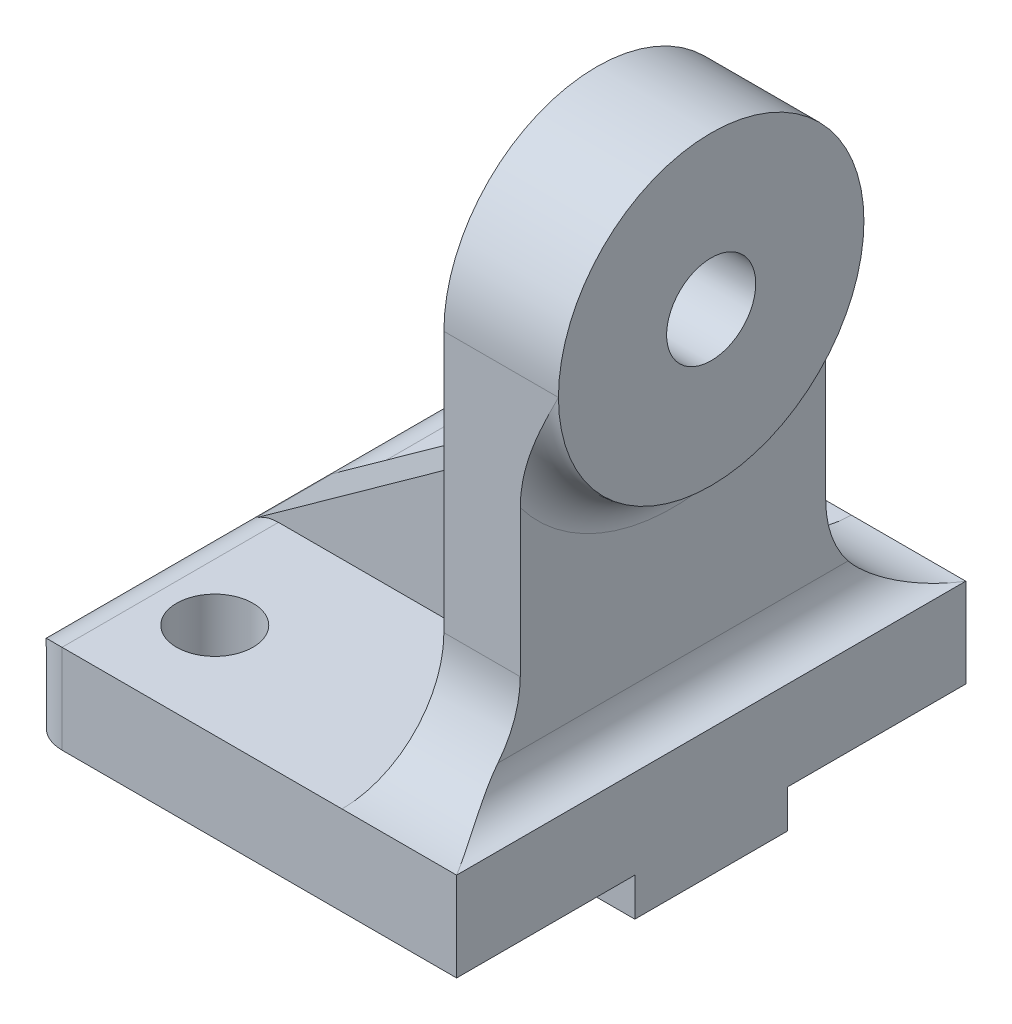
ISO-10303-21;
HEADER;
FILE_DESCRIPTION(('STEP AP214'),'2;1');
FILE_NAME('part.step','',(''),(''),'','','');
FILE_SCHEMA(('AUTOMOTIVE_DESIGN { 1 0 10303 214 1 1 1 1 }'));
ENDSEC;
DATA;
#1=APPLICATION_CONTEXT('core data for automotive mechanical design processes');
#2=APPLICATION_PROTOCOL_DEFINITION('international standard','automotive_design',2000,#1);
#3=PRODUCT_CONTEXT('',#1,'mechanical');
#4=PRODUCT('Part','Part','',(#3));
#5=PRODUCT_RELATED_PRODUCT_CATEGORY('part','',(#4));
#6=PRODUCT_DEFINITION_FORMATION('','',#4);
#7=PRODUCT_DEFINITION_CONTEXT('part definition',#1,'design');
#8=PRODUCT_DEFINITION('design','',#6,#7);
#9=PRODUCT_DEFINITION_SHAPE('','',#8);
#10=(LENGTH_UNIT() NAMED_UNIT(*) SI_UNIT(.MILLI.,.METRE.));
#11=(NAMED_UNIT(*) PLANE_ANGLE_UNIT() SI_UNIT($,.RADIAN.));
#12=(NAMED_UNIT(*) SI_UNIT($,.STERADIAN.) SOLID_ANGLE_UNIT());
#13=UNCERTAINTY_MEASURE_WITH_UNIT(LENGTH_MEASURE(1.E-05),#10,'distance_accuracy_value','');
#14=(GEOMETRIC_REPRESENTATION_CONTEXT(3) GLOBAL_UNCERTAINTY_ASSIGNED_CONTEXT((#13)) GLOBAL_UNIT_ASSIGNED_CONTEXT((#10,
#11,#12)) REPRESENTATION_CONTEXT('',''));
#15=CARTESIAN_POINT('',(0.,0.,0.));
#16=DIRECTION('',(0.,0.,1.));
#17=DIRECTION('',(1.,0.,0.));
#18=AXIS2_PLACEMENT_3D('',#15,#16,#17);
#19=CARTESIAN_POINT('',(6.,14.,-74.));
#20=DIRECTION('',(0.,-1.,0.));
#21=DIRECTION('',(0.,0.,-1.));
#22=AXIS2_PLACEMENT_3D('',#19,#20,#21);
#23=PLANE('',#22);
#24=CARTESIAN_POINT('',(15.,14.,-65.));
#25=DIRECTION('',(0.,1.,0.));
#26=DIRECTION('',(0.,0.,1.));
#27=AXIS2_PLACEMENT_3D('',#24,#25,#26);
#28=CIRCLE('',#27,6.);
#29=CARTESIAN_POINT('',(15.,14.,-59.));
#30=VERTEX_POINT('',#29);
#31=EDGE_CURVE('E441',#30,#30,#28,.T.);
#32=ORIENTED_EDGE('',*,*,#31,.F.);
#33=EDGE_LOOP('',(#32));
#34=FACE_BOUND('',#33,.T.);
#35=DIRECTION('',(1.,0.,0.));
#36=VECTOR('',#35,1.);
#37=CARTESIAN_POINT('',(50.,14.,-46.));
#38=LINE('',#37,#36);
#39=CARTESIAN_POINT('',(6.,14.,-46.));
#40=VERTEX_POINT('',#39);
#41=CARTESIAN_POINT('',(44.,14.,-46.));
#42=VERTEX_POINT('',#41);
#43=EDGE_CURVE('E206',#40,#42,#38,.T.);
#44=ORIENTED_EDGE('',*,*,#43,.T.);
#45=CARTESIAN_POINT('',(44.,14.,-52.));
#46=DIRECTION('',(0.,-1.,0.));
#47=DIRECTION('',(0.,0.,-1.));
#48=AXIS2_PLACEMENT_3D('',#45,#46,#47);
#49=CIRCLE('',#48,6.);
#50=CARTESIAN_POINT('',(50.,14.,-52.));
#51=VERTEX_POINT('',#50);
#52=EDGE_CURVE('E443',#42,#51,#49,.F.);
#53=ORIENTED_EDGE('',*,*,#52,.T.);
#54=DIRECTION('',(0.,0.,-1.));
#55=VECTOR('',#54,1.);
#56=CARTESIAN_POINT('',(50.,14.,0.));
#57=LINE('',#56,#55);
#58=CARTESIAN_POINT('',(50.,14.,-80.));
#59=VERTEX_POINT('',#58);
#60=EDGE_CURVE('E253',#51,#59,#57,.T.);
#61=ORIENTED_EDGE('',*,*,#60,.T.);
#62=DIRECTION('',(-1.,0.,0.));
#63=VECTOR('',#62,1.);
#64=CARTESIAN_POINT('',(6.00000000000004,14.,-80.));
#65=LINE('',#64,#63);
#66=CARTESIAN_POINT('',(6.00000000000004,14.,-80.));
#67=VERTEX_POINT('',#66);
#68=EDGE_CURVE('E526',#59,#67,#65,.T.);
#69=ORIENTED_EDGE('',*,*,#68,.T.);
#70=DIRECTION('',(0.,0.,1.));
#71=VECTOR('',#70,1.);
#72=CARTESIAN_POINT('',(6.,14.,-74.));
#73=LINE('',#72,#71);
#74=EDGE_CURVE('E446',#67,#40,#73,.T.);
#75=ORIENTED_EDGE('',*,*,#74,.T.);
#76=EDGE_LOOP('',(#44,#53,#61,#69,#75));
#77=FACE_BOUND('',#76,.T.);
#78=ADVANCED_FACE('F31',(#34,#77),#23,.F.);
#79=CARTESIAN_POINT('',(68.,14.,0.));
#80=DIRECTION('',(-1.,0.,0.));
#81=DIRECTION('',(0.,0.,1.));
#82=AXIS2_PLACEMENT_3D('',#79,#80,#81);
#83=PLANE('',#82);
#84=CARTESIAN_POINT('',(68.,71.,-40.));
#85=DIRECTION('',(1.,0.,0.));
#86=DIRECTION('',(0.,0.,-1.));
#87=AXIS2_PLACEMENT_3D('',#84,#85,#86);
#88=CIRCLE('',#87,7.);
#89=CARTESIAN_POINT('',(68.,71.,-47.));
#90=VERTEX_POINT('',#89);
#91=EDGE_CURVE('E234',#90,#90,#88,.T.);
#92=ORIENTED_EDGE('',*,*,#91,.F.);
#93=EDGE_LOOP('',(#92));
#94=FACE_BOUND('',#93,.T.);
#95=CARTESIAN_POINT('',(68.,71.,-40.));
#96=DIRECTION('',(1.,0.,0.));
#97=DIRECTION('',(0.,0.,-1.));
#98=AXIS2_PLACEMENT_3D('',#95,#96,#97);
#99=CIRCLE('',#98,24.);
#100=CARTESIAN_POINT('',(68.,71.,-64.));
#101=VERTEX_POINT('',#100);
#102=CARTESIAN_POINT('',(68.,71.,-16.));
#103=VERTEX_POINT('',#102);
#104=EDGE_CURVE('E241',#101,#103,#99,.T.);
#105=ORIENTED_EDGE('',*,*,#104,.T.);
#106=EDGE_CURVE('E240',#103,#101,#99,.T.);
#107=ORIENTED_EDGE('',*,*,#106,.T.);
#108=EDGE_LOOP('',(#105,#107));
#109=FACE_BOUND('',#108,.T.);
#110=ADVANCED_FACE('F430',(#94,#109),#83,.F.);
#111=CARTESIAN_POINT('',(50.,71.,-64.));
#112=DIRECTION('',(0.,0.,-1.));
#113=DIRECTION('',(-1.,0.,0.));
#114=AXIS2_PLACEMENT_3D('',#111,#112,#113);
#115=PLANE('',#114);
#116=DIRECTION('',(1.,0.,0.));
#117=VECTOR('',#116,1.);
#118=CARTESIAN_POINT('',(50.,71.,-64.));
#119=LINE('',#118,#117);
#120=CARTESIAN_POINT('',(50.,71.,-64.));
#121=VERTEX_POINT('',#120);
#122=EDGE_CURVE('E263',#121,#101,#119,.T.);
#123=ORIENTED_EDGE('',*,*,#122,.T.);
#124=CARTESIAN_POINT('',(62.,53.,-64.));
#125=CARTESIAN_POINT('',(62.000029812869,53.3181540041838,-64.));
#126=CARTESIAN_POINT('',(62.0091079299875,53.6362128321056,-64.));
#127=CARTESIAN_POINT('',(62.0437153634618,54.2712663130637,-64.));
#128=CARTESIAN_POINT('',(62.0692353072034,54.5882614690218,-64.));
#129=CARTESIAN_POINT('',(62.1349879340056,55.2197479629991,-64.));
#130=CARTESIAN_POINT('',(62.1751771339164,55.5342439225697,-64.));
#131=CARTESIAN_POINT('',(62.2688601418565,56.161272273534,-64.));
#132=CARTESIAN_POINT('',(62.322356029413,56.473804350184,-64.));
#133=CARTESIAN_POINT('',(62.4992524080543,57.3997546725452,-64.));
#134=CARTESIAN_POINT('',(62.6400061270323,58.0098916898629,-64.));
#135=CARTESIAN_POINT('',(62.9594935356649,59.2204557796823,-64.));
#136=CARTESIAN_POINT('',(63.1382598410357,59.8208740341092,-64.));
#137=CARTESIAN_POINT('',(63.4810838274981,60.8728166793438,-64.));
#138=CARTESIAN_POINT('',(63.6388530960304,61.3264172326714,-64.));
#139=CARTESIAN_POINT('',(63.9694736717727,62.2281048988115,-64.));
#140=CARTESIAN_POINT('',(64.1423262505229,62.6761915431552,-64.));
#141=CARTESIAN_POINT('',(64.679497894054,64.0129020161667,-64.));
#142=CARTESIAN_POINT('',(65.062445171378,64.8940186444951,-64.));
#143=CARTESIAN_POINT('',(65.8610721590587,66.645119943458,-64.));
#144=CARTESIAN_POINT('',(66.2768740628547,67.5150475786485,-64.));
#145=CARTESIAN_POINT('',(67.1238083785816,69.2474292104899,-64.));
#146=CARTESIAN_POINT('',(67.5549422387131,70.1098824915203,-64.));
#147=CARTESIAN_POINT('',(67.9907623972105,70.981524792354,-64.));
#148=CARTESIAN_POINT('',(67.99538119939,70.9907623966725,-64.));
#149=CARTESIAN_POINT('',(68.,71.,-64.));
#150=B_SPLINE_CURVE_WITH_KNOTS('',3,(#124,#125,#126,#127,#128,#129,#130,#131,#132,#133,#134,
#135,#136,#137,#138,#139,#140,#141,#142,#143,#144,#145,#146,#147,#148,#149),.UNSPECIFIED.,.F.,
.F.,(4,2,2,2,2,2,2,2,2,2,2,2,4),(0.,0.954195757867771,1.90784805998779,2.85869616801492,
3.80969296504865,5.68650542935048,7.5649347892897,9.00540329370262,10.4459933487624,
13.3270398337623,16.2193574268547,19.1119489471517,19.1429328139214),.UNSPECIFIED.);
#151=CARTESIAN_POINT('',(62.,53.,-64.));
#152=VERTEX_POINT('',#151);
#153=EDGE_CURVE('E339',#101,#152,#150,.F.);
#154=ORIENTED_EDGE('',*,*,#153,.T.);
#155=DIRECTION('',(0.,1.,0.));
#156=VECTOR('',#155,1.);
#157=CARTESIAN_POINT('',(62.,71.,-64.));
#158=LINE('',#157,#156);
#159=CARTESIAN_POINT('',(62.,30.,-64.));
#160=VERTEX_POINT('',#159);
#161=EDGE_CURVE('E229',#160,#152,#158,.T.);
#162=ORIENTED_EDGE('',*,*,#161,.F.);
#163=DIRECTION('',(1.,0.,0.));
#164=VECTOR('',#163,1.);
#165=CARTESIAN_POINT('',(50.,30.,-64.));
#166=LINE('',#165,#164);
#167=CARTESIAN_POINT('',(50.,30.,-64.));
#168=VERTEX_POINT('',#167);
#169=EDGE_CURVE('E266',#168,#160,#166,.T.);
#170=ORIENTED_EDGE('',*,*,#169,.F.);
#171=DIRECTION('',(0.,1.,0.));
#172=VECTOR('',#171,1.);
#173=CARTESIAN_POINT('',(50.,71.,-64.));
#174=LINE('',#173,#172);
#175=EDGE_CURVE('E259',#168,#121,#174,.T.);
#176=ORIENTED_EDGE('',*,*,#175,.T.);
#177=EDGE_LOOP('',(#123,#154,#162,#170,#176));
#178=FACE_BOUND('',#177,.T.);
#179=ADVANCED_FACE('F436',(#178),#115,.T.);
#180=CARTESIAN_POINT('',(50.,30.,-80.));
#181=DIRECTION('',(1.,0.,0.));
#182=DIRECTION('',(0.,0.,-1.));
#183=AXIS2_PLACEMENT_3D('',#180,#181,#182);
#184=CYLINDRICAL_SURFACE('',#183,16.);
#185=ORIENTED_EDGE('',*,*,#169,.T.);
#186=CARTESIAN_POINT('',(62.,30.,-80.));
#187=DIRECTION('',(-1.,0.,0.));
#188=DIRECTION('',(0.,0.,-1.));
#189=AXIS2_PLACEMENT_3D('',#186,#187,#188);
#190=CIRCLE('',#189,16.);
#191=CARTESIAN_POINT('',(62.,20.,-67.5100040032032));
#192=VERTEX_POINT('',#191);
#193=EDGE_CURVE('E227',#192,#160,#190,.T.);
#194=ORIENTED_EDGE('',*,*,#193,.F.);
#195=CARTESIAN_POINT('',(62.,20.,-67.5100040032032));
#196=CARTESIAN_POINT('',(62.0000229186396,19.8002548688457,-67.6698796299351));
#197=CARTESIAN_POINT('',(62.0099695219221,19.6045281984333,-67.8344938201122));
#198=CARTESIAN_POINT('',(62.0475068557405,19.222386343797,-68.1717475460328));
#199=CARTESIAN_POINT('',(62.0750702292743,19.0359572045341,-68.3443742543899));
#200=CARTESIAN_POINT('',(62.145346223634,18.6746293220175,-68.6951804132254));
#201=CARTESIAN_POINT('',(62.187925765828,18.4996448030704,-68.8732989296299));
#202=CARTESIAN_POINT('',(62.2864064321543,18.1598489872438,-69.2355894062));
#203=CARTESIAN_POINT('',(62.3423148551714,17.9950433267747,-69.4197646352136));
#204=CARTESIAN_POINT('',(62.4967237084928,17.595837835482,-69.8869976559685));
#205=CARTESIAN_POINT('',(62.6025181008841,17.368019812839,-70.1732938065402));
#206=CARTESIAN_POINT('',(62.8353556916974,16.9362370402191,-70.7550312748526));
#207=CARTESIAN_POINT('',(62.9624055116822,16.7322797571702,-71.0504754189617));
#208=CARTESIAN_POINT('',(63.2345049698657,16.3467782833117,-71.6503081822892));
#209=CARTESIAN_POINT('',(63.379653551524,16.1653691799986,-71.954738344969));
#210=CARTESIAN_POINT('',(63.6840108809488,15.8257665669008,-72.5693602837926));
#211=CARTESIAN_POINT('',(63.8432196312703,15.6675730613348,-72.8795520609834));
#212=CARTESIAN_POINT('',(64.241826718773,15.3123360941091,-73.6350804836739));
#213=CARTESIAN_POINT('',(64.4869495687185,15.1266531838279,-74.0827633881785));
#214=CARTESIAN_POINT('',(64.9936661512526,14.7987436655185,-74.9847965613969));
#215=CARTESIAN_POINT('',(65.2552681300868,14.6565390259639,-75.4391500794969));
#216=CARTESIAN_POINT('',(65.789251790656,14.4144528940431,-76.3513152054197));
#217=CARTESIAN_POINT('',(66.0616092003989,14.3144814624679,-76.8091173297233));
#218=CARTESIAN_POINT('',(66.6133077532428,14.1553917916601,-77.7272659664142));
#219=CARTESIAN_POINT('',(66.8926449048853,14.0962507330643,-78.1876109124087));
#220=CARTESIAN_POINT('',(67.3086684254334,14.0384026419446,-78.8700367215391));
#221=CARTESIAN_POINT('',(67.4440943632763,14.0242609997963,-79.0916904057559));
#222=CARTESIAN_POINT('',(67.7152789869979,14.0052190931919,-79.5350445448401));
#223=CARTESIAN_POINT('',(67.8510374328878,14.0003134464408,-79.756744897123));
#224=CARTESIAN_POINT('',(67.9911923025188,14.0000048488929,-79.9856170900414));
#225=CARTESIAN_POINT('',(67.9955961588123,14.0000000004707,-79.9928085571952));
#226=CARTESIAN_POINT('',(68.,14.,-80.));
#227=B_SPLINE_CURVE_WITH_KNOTS('',3,(#195,#196,#197,#198,#199,#200,#201,#202,#203,#204,#205,
#206,#207,#208,#209,#210,#211,#212,#213,#214,#215,#216,#217,#218,#219,#220,#221,#222,#223,#224,
#225,#226),.UNSPECIFIED.,.F.,.F.,(4,2,2,2,2,2,2,2,2,2,2,2,2,2,2,4),(0.,0.767024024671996,
1.53285982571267,2.29207235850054,3.05170159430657,4.19255688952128,5.33376825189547,
6.48151709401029,7.62926614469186,9.25627785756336,10.8841103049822,12.5084584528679,
14.1318980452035,14.9121815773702,15.6920102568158,15.7173084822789),.UNSPECIFIED.);
#228=CARTESIAN_POINT('',(68.,14.,-80.));
#229=VERTEX_POINT('',#228);
#230=EDGE_CURVE('E476',#192,#229,#227,.T.);
#231=ORIENTED_EDGE('',*,*,#230,.T.);
#232=EDGE_CURVE('E521',#229,#59,#65,.T.);
#233=ORIENTED_EDGE('',*,*,#232,.T.);
#234=CARTESIAN_POINT('',(50.,30.,-80.));
#235=DIRECTION('',(-1.,0.,0.));
#236=DIRECTION('',(0.,0.,-1.));
#237=AXIS2_PLACEMENT_3D('',#234,#235,#236);
#238=CIRCLE('',#237,16.);
#239=EDGE_CURVE('E256',#59,#168,#238,.T.);
#240=ORIENTED_EDGE('',*,*,#239,.T.);
#241=EDGE_LOOP('',(#185,#194,#231,#233,#240));
#242=FACE_BOUND('',#241,.T.);
#243=ADVANCED_FACE('F757',(#242),#184,.F.);
#244=CARTESIAN_POINT('',(50.,30.,0.));
#245=DIRECTION('',(1.,0.,0.));
#246=DIRECTION('',(0.,0.,-1.));
#247=AXIS2_PLACEMENT_3D('',#244,#245,#246);
#248=CYLINDRICAL_SURFACE('',#247,16.);
#249=DIRECTION('',(1.,0.,0.));
#250=VECTOR('',#249,1.);
#251=CARTESIAN_POINT('',(50.,14.,0.));
#252=LINE('',#251,#250);
#253=CARTESIAN_POINT('',(50.,14.,0.));
#254=VERTEX_POINT('',#253);
#255=CARTESIAN_POINT('',(68.,14.,0.));
#256=VERTEX_POINT('',#255);
#257=EDGE_CURVE('E269',#254,#256,#252,.T.);
#258=ORIENTED_EDGE('',*,*,#257,.T.);
#259=CARTESIAN_POINT('',(62.,20.,-12.4899959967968));
#260=CARTESIAN_POINT('',(62.0000229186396,19.8002548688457,-12.3301203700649));
#261=CARTESIAN_POINT('',(62.0099695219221,19.6045281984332,-12.1655061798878));
#262=CARTESIAN_POINT('',(62.0475068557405,19.2223863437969,-11.8282524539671));
#263=CARTESIAN_POINT('',(62.0750702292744,19.035957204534,-11.65562574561));
#264=CARTESIAN_POINT('',(62.145346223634,18.6746293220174,-11.3048195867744));
#265=CARTESIAN_POINT('',(62.1879257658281,18.4996448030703,-11.12670107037));
#266=CARTESIAN_POINT('',(62.2864064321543,18.1598489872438,-10.7644105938));
#267=CARTESIAN_POINT('',(62.3423148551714,17.9950433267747,-10.5802353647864));
#268=CARTESIAN_POINT('',(62.4967237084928,17.595837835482,-10.1130023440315));
#269=CARTESIAN_POINT('',(62.6025181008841,17.368019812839,-9.8267061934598));
#270=CARTESIAN_POINT('',(62.8353556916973,16.9362370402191,-9.24496872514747));
#271=CARTESIAN_POINT('',(62.9624055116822,16.7322797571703,-8.94952458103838));
#272=CARTESIAN_POINT('',(63.2345049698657,16.3467782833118,-8.34969181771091));
#273=CARTESIAN_POINT('',(63.379653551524,16.1653691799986,-8.0452616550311));
#274=CARTESIAN_POINT('',(63.6840108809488,15.8257665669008,-7.43063971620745));
#275=CARTESIAN_POINT('',(63.8432196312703,15.6675730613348,-7.12044793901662));
#276=CARTESIAN_POINT('',(64.241826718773,15.3123360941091,-6.36491951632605));
#277=CARTESIAN_POINT('',(64.4869495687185,15.1266531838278,-5.91723661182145));
#278=CARTESIAN_POINT('',(64.9936661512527,14.7987436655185,-5.01520343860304));
#279=CARTESIAN_POINT('',(65.2552681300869,14.6565390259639,-4.56084992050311));
#280=CARTESIAN_POINT('',(65.789251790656,14.4144528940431,-3.64868479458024));
#281=CARTESIAN_POINT('',(66.0616092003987,14.3144814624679,-3.19088267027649));
#282=CARTESIAN_POINT('',(66.613307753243,14.1553917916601,-2.2727340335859));
#283=CARTESIAN_POINT('',(66.892644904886,14.0962507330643,-1.8123890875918));
#284=CARTESIAN_POINT('',(67.308668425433,14.0384026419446,-1.12996327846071));
#285=CARTESIAN_POINT('',(67.4440943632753,14.0242609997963,-0.908309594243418));
#286=CARTESIAN_POINT('',(67.715278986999,14.0052190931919,-0.464955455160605));
#287=CARTESIAN_POINT('',(67.8510374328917,14.0003134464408,-0.243255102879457));
#288=CARTESIAN_POINT('',(67.991192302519,14.0000048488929,-0.0143829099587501));
#289=CARTESIAN_POINT('',(67.9955961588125,14.0000000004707,-0.0071914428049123));
#290=CARTESIAN_POINT('',(68.,14.,0.));
#291=B_SPLINE_CURVE_WITH_KNOTS('',3,(#259,#260,#261,#262,#263,#264,#265,#266,#267,#268,#269,
#270,#271,#272,#273,#274,#275,#276,#277,#278,#279,#280,#281,#282,#283,#284,#285,#286,#287,#288,
#289,#290),.UNSPECIFIED.,.F.,.F.,(4,2,2,2,2,2,2,2,2,2,2,2,2,2,2,4),(0.,0.767024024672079,
1.53285982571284,2.29207235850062,3.05170159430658,4.19255688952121,5.33376825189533,
6.48151709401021,7.62926614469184,9.25627785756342,10.8841103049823,12.508458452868,
14.1318980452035,14.9121815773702,15.6920102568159,15.7173084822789),.UNSPECIFIED.);
#292=CARTESIAN_POINT('',(62.,20.,-12.4899959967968));
#293=VERTEX_POINT('',#292);
#294=EDGE_CURVE('E472',#256,#293,#291,.F.);
#295=ORIENTED_EDGE('',*,*,#294,.T.);
#296=CARTESIAN_POINT('',(62.,30.,0.));
#297=DIRECTION('',(-1.,0.,0.));
#298=DIRECTION('',(0.,0.,-1.));
#299=AXIS2_PLACEMENT_3D('',#296,#297,#298);
#300=CIRCLE('',#299,16.);
#301=CARTESIAN_POINT('',(62.,30.,-16.));
#302=VERTEX_POINT('',#301);
#303=EDGE_CURVE('E224',#302,#293,#300,.T.);
#304=ORIENTED_EDGE('',*,*,#303,.F.);
#305=DIRECTION('',(1.,0.,0.));
#306=VECTOR('',#305,1.);
#307=CARTESIAN_POINT('',(50.,30.,-16.));
#308=LINE('',#307,#306);
#309=CARTESIAN_POINT('',(50.,30.,-16.));
#310=VERTEX_POINT('',#309);
#311=EDGE_CURVE('E271',#310,#302,#308,.T.);
#312=ORIENTED_EDGE('',*,*,#311,.F.);
#313=CARTESIAN_POINT('',(50.,30.,0.));
#314=DIRECTION('',(-1.,0.,0.));
#315=DIRECTION('',(0.,0.,-1.));
#316=AXIS2_PLACEMENT_3D('',#313,#314,#315);
#317=CIRCLE('',#316,16.);
#318=EDGE_CURVE('E250',#310,#254,#317,.T.);
#319=ORIENTED_EDGE('',*,*,#318,.T.);
#320=EDGE_LOOP('',(#258,#295,#304,#312,#319));
#321=FACE_BOUND('',#320,.T.);
#322=ADVANCED_FACE('F355',(#321),#248,.F.);
#323=CARTESIAN_POINT('',(50.,71.,-16.));
#324=DIRECTION('',(0.,0.,1.));
#325=DIRECTION('',(0.,-1.,0.));
#326=AXIS2_PLACEMENT_3D('',#323,#324,#325);
#327=PLANE('',#326);
#328=ORIENTED_EDGE('',*,*,#311,.T.);
#329=DIRECTION('',(0.,-1.,0.));
#330=VECTOR('',#329,1.);
#331=CARTESIAN_POINT('',(62.,71.,-16.));
#332=LINE('',#331,#330);
#333=CARTESIAN_POINT('',(62.,53.,-16.));
#334=VERTEX_POINT('',#333);
#335=EDGE_CURVE('E232',#334,#302,#332,.T.);
#336=ORIENTED_EDGE('',*,*,#335,.F.);
#337=CARTESIAN_POINT('',(62.,53.,-16.));
#338=CARTESIAN_POINT('',(62.000029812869,53.318154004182,-16.));
#339=CARTESIAN_POINT('',(62.0091079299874,53.6362128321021,-16.));
#340=CARTESIAN_POINT('',(62.0437153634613,54.2712663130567,-16.));
#341=CARTESIAN_POINT('',(62.0692353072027,54.5882614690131,-16.));
#342=CARTESIAN_POINT('',(62.1349879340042,55.2197479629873,-16.));
#343=CARTESIAN_POINT('',(62.1751771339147,55.5342439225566,-16.));
#344=CARTESIAN_POINT('',(62.268860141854,56.1612722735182,-16.));
#345=CARTESIAN_POINT('',(62.32235602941,56.4738043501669,-16.));
#346=CARTESIAN_POINT('',(62.4992524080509,57.3997546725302,-16.));
#347=CARTESIAN_POINT('',(62.6400061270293,58.0098916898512,-16.));
#348=CARTESIAN_POINT('',(62.9594935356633,59.2204557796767,-16.));
#349=CARTESIAN_POINT('',(63.1382598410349,59.8208740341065,-16.));
#350=CARTESIAN_POINT('',(63.4810838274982,60.8728166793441,-16.));
#351=CARTESIAN_POINT('',(63.6388530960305,61.326417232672,-16.));
#352=CARTESIAN_POINT('',(63.9694736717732,62.2281048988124,-16.));
#353=CARTESIAN_POINT('',(64.1423262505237,62.6761915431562,-16.));
#354=CARTESIAN_POINT('',(64.6794978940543,64.0129020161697,-16.));
#355=CARTESIAN_POINT('',(65.0624451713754,64.894018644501,-16.));
#356=CARTESIAN_POINT('',(65.861072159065,66.6451199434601,-16.));
#357=CARTESIAN_POINT('',(66.2768740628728,67.5150475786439,-16.));
#358=CARTESIAN_POINT('',(67.1238083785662,69.2474292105,-16.));
#359=CARTESIAN_POINT('',(67.5549422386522,70.1098824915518,-15.9999999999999));
#360=CARTESIAN_POINT('',(67.9907623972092,70.9815247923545,-16.));
#361=CARTESIAN_POINT('',(67.9953811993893,70.9907623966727,-16.));
#362=CARTESIAN_POINT('',(68.,71.,-16.));
#363=B_SPLINE_CURVE_WITH_KNOTS('',3,(#337,#338,#339,#340,#341,#342,#343,#344,#345,#346,#347,
#348,#349,#350,#351,#352,#353,#354,#355,#356,#357,#358,#359,#360,#361,#362),.UNSPECIFIED.,.F.,
.F.,(4,2,2,2,2,2,2,2,2,2,2,2,4),(0.,0.95419575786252,1.90784805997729,2.85869616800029,
3.80969296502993,5.68650542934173,7.56493478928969,9.00540329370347,10.4459933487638,
13.3270398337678,16.2193574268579,19.1119489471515,19.1429328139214),.UNSPECIFIED.);
#364=EDGE_CURVE('E331',#334,#103,#363,.T.);
#365=ORIENTED_EDGE('',*,*,#364,.T.);
#366=DIRECTION('',(1.,0.,0.));
#367=VECTOR('',#366,1.);
#368=CARTESIAN_POINT('',(50.,71.,-16.));
#369=LINE('',#368,#367);
#370=CARTESIAN_POINT('',(50.,71.,-16.));
#371=VERTEX_POINT('',#370);
#372=EDGE_CURVE('E262',#371,#103,#369,.T.);
#373=ORIENTED_EDGE('',*,*,#372,.F.);
#374=DIRECTION('',(0.,-1.,0.));
#375=VECTOR('',#374,1.);
#376=CARTESIAN_POINT('',(50.,71.,-16.));
#377=LINE('',#376,#375);
#378=EDGE_CURVE('E247',#371,#310,#377,.T.);
#379=ORIENTED_EDGE('',*,*,#378,.T.);
#380=EDGE_LOOP('',(#328,#336,#365,#373,#379));
#381=FACE_BOUND('',#380,.T.);
#382=ADVANCED_FACE('F349',(#381),#327,.T.);
#383=CARTESIAN_POINT('',(15.,14.,-15.));
#384=DIRECTION('',(0.,1.,0.));
#385=DIRECTION('',(0.,0.,1.));
#386=AXIS2_PLACEMENT_3D('',#383,#384,#385);
#387=CIRCLE('',#386,6.);
#388=CARTESIAN_POINT('',(15.,14.,-9.));
#389=VERTEX_POINT('',#388);
#390=EDGE_CURVE('E588',#389,#389,#387,.T.);
#391=ORIENTED_EDGE('',*,*,#390,.F.);
#392=EDGE_LOOP('',(#391));
#393=FACE_BOUND('',#392,.T.);
#394=CARTESIAN_POINT('',(50.,14.,-28.));
#395=VERTEX_POINT('',#394);
#396=EDGE_CURVE('E254',#254,#395,#57,.T.);
#397=ORIENTED_EDGE('',*,*,#396,.T.);
#398=CARTESIAN_POINT('',(44.,14.,-28.));
#399=DIRECTION('',(0.,-1.,0.));
#400=DIRECTION('',(0.,0.,-1.));
#401=AXIS2_PLACEMENT_3D('',#398,#399,#400);
#402=CIRCLE('',#401,6.);
#403=CARTESIAN_POINT('',(44.,14.,-34.));
#404=VERTEX_POINT('',#403);
#405=EDGE_CURVE('E46',#395,#404,#402,.F.);
#406=ORIENTED_EDGE('',*,*,#405,.T.);
#407=DIRECTION('',(1.,0.,0.));
#408=VECTOR('',#407,1.);
#409=CARTESIAN_POINT('',(50.,14.,-34.));
#410=LINE('',#409,#408);
#411=CARTESIAN_POINT('',(6.,14.,-34.));
#412=VERTEX_POINT('',#411);
#413=EDGE_CURVE('E215',#412,#404,#410,.T.);
#414=ORIENTED_EDGE('',*,*,#413,.F.);
#415=CARTESIAN_POINT('',(6.00000000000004,14.,0.));
#416=VERTEX_POINT('',#415);
#417=EDGE_CURVE('E471',#412,#416,#73,.T.);
#418=ORIENTED_EDGE('',*,*,#417,.T.);
#419=DIRECTION('',(1.,0.,0.));
#420=VECTOR('',#419,1.);
#421=CARTESIAN_POINT('',(6.00000000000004,14.,0.));
#422=LINE('',#421,#420);
#423=EDGE_CURVE('E518',#416,#254,#422,.T.);
#424=ORIENTED_EDGE('',*,*,#423,.T.);
#425=EDGE_LOOP('',(#397,#406,#414,#418,#424));
#426=FACE_BOUND('',#425,.T.);
#427=ADVANCED_FACE('F354',(#393,#426),#23,.F.);
#428=CARTESIAN_POINT('',(6.,0.,-74.));
#429=DIRECTION('',(0.,-1.,0.));
#430=DIRECTION('',(0.,0.,-1.));
#431=AXIS2_PLACEMENT_3D('',#428,#429,#430);
#432=PLANE('',#431);
#433=DIRECTION('',(1.,0.,0.));
#434=VECTOR('',#433,1.);
#435=CARTESIAN_POINT('',(68.,0.,-52.));
#436=LINE('',#435,#434);
#437=CARTESIAN_POINT('',(0.,0.,-52.));
#438=VERTEX_POINT('',#437);
#439=CARTESIAN_POINT('',(68.,0.,-52.));
#440=VERTEX_POINT('',#439);
#441=EDGE_CURVE('E295',#438,#440,#436,.T.);
#442=ORIENTED_EDGE('',*,*,#441,.F.);
#443=DIRECTION('',(0.,0.,1.));
#444=VECTOR('',#443,1.);
#445=CARTESIAN_POINT('',(0.,0.,-6.00000000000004));
#446=LINE('',#445,#444);
#447=CARTESIAN_POINT('',(0.,0.,-74.));
#448=VERTEX_POINT('',#447);
#449=EDGE_CURVE('E555',#448,#438,#446,.T.);
#450=ORIENTED_EDGE('',*,*,#449,.F.);
#451=CARTESIAN_POINT('',(6.,0.,-74.));
#452=DIRECTION('',(0.,1.,0.));
#453=DIRECTION('',(0.,0.,-1.));
#454=AXIS2_PLACEMENT_3D('',#451,#452,#453);
#455=CIRCLE('',#454,6.);
#456=CARTESIAN_POINT('',(6.00000000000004,0.,-80.));
#457=VERTEX_POINT('',#456);
#458=EDGE_CURVE('E550',#457,#448,#455,.T.);
#459=ORIENTED_EDGE('',*,*,#458,.F.);
#460=DIRECTION('',(-1.,0.,0.));
#461=VECTOR('',#460,1.);
#462=CARTESIAN_POINT('',(6.00000000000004,0.,-80.));
#463=LINE('',#462,#461);
#464=CARTESIAN_POINT('',(68.,0.,-80.));
#465=VERTEX_POINT('',#464);
#466=EDGE_CURVE('E542',#465,#457,#463,.T.);
#467=ORIENTED_EDGE('',*,*,#466,.F.);
#468=DIRECTION('',(0.,0.,-1.));
#469=VECTOR('',#468,1.);
#470=CARTESIAN_POINT('',(68.,0.,0.));
#471=LINE('',#470,#469);
#472=EDGE_CURVE('E543',#440,#465,#471,.T.);
#473=ORIENTED_EDGE('',*,*,#472,.F.);
#474=EDGE_LOOP('',(#442,#450,#459,#467,#473));
#475=FACE_BOUND('',#474,.T.);
#476=CARTESIAN_POINT('',(15.,0.,-65.));
#477=DIRECTION('',(0.,1.,0.));
#478=DIRECTION('',(0.,0.,1.));
#479=AXIS2_PLACEMENT_3D('',#476,#477,#478);
#480=CIRCLE('',#479,6.);
#481=CARTESIAN_POINT('',(15.,0.,-59.));
#482=VERTEX_POINT('',#481);
#483=EDGE_CURVE('E590',#482,#482,#480,.T.);
#484=ORIENTED_EDGE('',*,*,#483,.T.);
#485=EDGE_LOOP('',(#484));
#486=FACE_BOUND('',#485,.T.);
#487=ADVANCED_FACE('F404',(#475,#486),#432,.T.);
#488=DIRECTION('',(-1.,0.,0.));
#489=VECTOR('',#488,1.);
#490=CARTESIAN_POINT('',(68.,0.,-28.));
#491=LINE('',#490,#489);
#492=CARTESIAN_POINT('',(68.,0.,-28.));
#493=VERTEX_POINT('',#492);
#494=CARTESIAN_POINT('',(0.,0.,-28.));
#495=VERTEX_POINT('',#494);
#496=EDGE_CURVE('E286',#493,#495,#491,.T.);
#497=ORIENTED_EDGE('',*,*,#496,.F.);
#498=CARTESIAN_POINT('',(68.,0.,0.));
#499=VERTEX_POINT('',#498);
#500=EDGE_CURVE('E538',#499,#493,#471,.T.);
#501=ORIENTED_EDGE('',*,*,#500,.F.);
#502=DIRECTION('',(1.,0.,0.));
#503=VECTOR('',#502,1.);
#504=CARTESIAN_POINT('',(6.00000000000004,0.,0.));
#505=LINE('',#504,#503);
#506=CARTESIAN_POINT('',(6.00000000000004,0.,0.));
#507=VERTEX_POINT('',#506);
#508=EDGE_CURVE('E559',#507,#499,#505,.T.);
#509=ORIENTED_EDGE('',*,*,#508,.F.);
#510=CARTESIAN_POINT('',(6.,0.,-6.));
#511=DIRECTION('',(0.,1.,0.));
#512=DIRECTION('',(0.,0.,-1.));
#513=AXIS2_PLACEMENT_3D('',#510,#511,#512);
#514=CIRCLE('',#513,6.);
#515=CARTESIAN_POINT('',(0.,0.,-6.00000000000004));
#516=VERTEX_POINT('',#515);
#517=EDGE_CURVE('E513',#516,#507,#514,.T.);
#518=ORIENTED_EDGE('',*,*,#517,.F.);
#519=EDGE_CURVE('E296',#495,#516,#446,.T.);
#520=ORIENTED_EDGE('',*,*,#519,.F.);
#521=EDGE_LOOP('',(#497,#501,#509,#518,#520));
#522=FACE_BOUND('',#521,.T.);
#523=CARTESIAN_POINT('',(15.,0.,-15.));
#524=DIRECTION('',(0.,1.,0.));
#525=DIRECTION('',(0.,0.,1.));
#526=AXIS2_PLACEMENT_3D('',#523,#524,#525);
#527=CIRCLE('',#526,6.);
#528=CARTESIAN_POINT('',(15.,0.,-9.));
#529=VERTEX_POINT('',#528);
#530=EDGE_CURVE('E308',#529,#529,#527,.T.);
#531=ORIENTED_EDGE('',*,*,#530,.T.);
#532=EDGE_LOOP('',(#531));
#533=FACE_BOUND('',#532,.T.);
#534=ADVANCED_FACE('F401',(#522,#533),#432,.T.);
#535=DIRECTION('',(0.,-1.,0.));
#536=VECTOR('',#535,1.);
#537=CARTESIAN_POINT('',(68.,14.,-80.));
#538=LINE('',#537,#536);
#539=EDGE_CURVE('E328',#229,#465,#538,.T.);
#540=ORIENTED_EDGE('',*,*,#539,.F.);
#541=DIRECTION('',(0.,0.,-1.));
#542=VECTOR('',#541,1.);
#543=CARTESIAN_POINT('',(68.,14.,0.));
#544=LINE('',#543,#542);
#545=EDGE_CURVE('E217',#256,#229,#544,.T.);
#546=ORIENTED_EDGE('',*,*,#545,.F.);
#547=DIRECTION('',(0.,-1.,0.));
#548=VECTOR('',#547,1.);
#549=CARTESIAN_POINT('',(68.,14.,0.));
#550=LINE('',#549,#548);
#551=EDGE_CURVE('E516',#256,#499,#550,.T.);
#552=ORIENTED_EDGE('',*,*,#551,.T.);
#553=ORIENTED_EDGE('',*,*,#500,.T.);
#554=DIRECTION('',(0.,1.,0.));
#555=VECTOR('',#554,1.);
#556=CARTESIAN_POINT('',(68.,-6.,-28.));
#557=LINE('',#556,#555);
#558=CARTESIAN_POINT('',(68.,-6.,-28.));
#559=VERTEX_POINT('',#558);
#560=EDGE_CURVE('E302',#559,#493,#557,.T.);
#561=ORIENTED_EDGE('',*,*,#560,.F.);
#562=DIRECTION('',(0.,0.,1.));
#563=VECTOR('',#562,1.);
#564=CARTESIAN_POINT('',(68.,-6.,-28.));
#565=LINE('',#564,#563);
#566=CARTESIAN_POINT('',(68.,-6.,-52.));
#567=VERTEX_POINT('',#566);
#568=EDGE_CURVE('E313',#567,#559,#565,.T.);
#569=ORIENTED_EDGE('',*,*,#568,.F.);
#570=DIRECTION('',(0.,1.,0.));
#571=VECTOR('',#570,1.);
#572=CARTESIAN_POINT('',(68.,-6.,-52.));
#573=LINE('',#572,#571);
#574=EDGE_CURVE('E314',#567,#440,#573,.T.);
#575=ORIENTED_EDGE('',*,*,#574,.T.);
#576=ORIENTED_EDGE('',*,*,#472,.T.);
#577=EDGE_LOOP('',(#540,#546,#552,#553,#561,#569,#575,#576));
#578=FACE_BOUND('',#577,.T.);
#579=ADVANCED_FACE('F33',(#578),#83,.F.);
#580=CARTESIAN_POINT('',(6.00000000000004,14.,-80.));
#581=DIRECTION('',(0.,0.,1.));
#582=DIRECTION('',(1.,0.,0.));
#583=AXIS2_PLACEMENT_3D('',#580,#581,#582);
#584=PLANE('',#583);
#585=ORIENTED_EDGE('',*,*,#466,.T.);
#586=DIRECTION('',(0.,-1.,0.));
#587=VECTOR('',#586,1.);
#588=CARTESIAN_POINT('',(6.00000000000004,14.,-80.));
#589=LINE('',#588,#587);
#590=EDGE_CURVE('E533',#67,#457,#589,.T.);
#591=ORIENTED_EDGE('',*,*,#590,.F.);
#592=ORIENTED_EDGE('',*,*,#68,.F.);
#593=ORIENTED_EDGE('',*,*,#232,.F.);
#594=ORIENTED_EDGE('',*,*,#539,.T.);
#595=EDGE_LOOP('',(#585,#591,#592,#593,#594));
#596=FACE_BOUND('',#595,.T.);
#597=ADVANCED_FACE('F422',(#596),#584,.F.);
#598=CARTESIAN_POINT('',(6.,14.,-74.));
#599=DIRECTION('',(0.,-1.,0.));
#600=DIRECTION('',(0.,0.,-1.));
#601=AXIS2_PLACEMENT_3D('',#598,#599,#600);
#602=CYLINDRICAL_SURFACE('',#601,6.);
#603=DIRECTION('',(0.,-1.,0.));
#604=VECTOR('',#603,1.);
#605=CARTESIAN_POINT('',(0.,14.,-74.));
#606=LINE('',#605,#604);
#607=CARTESIAN_POINT('',(0.,8.,-74.));
#608=VERTEX_POINT('',#607);
#609=EDGE_CURVE('E531',#608,#448,#606,.T.);
#610=ORIENTED_EDGE('',*,*,#609,.F.);
#611=CARTESIAN_POINT('',(6.,8.,-74.));
#612=DIRECTION('',(0.,0.707106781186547,0.707106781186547));
#613=DIRECTION('',(0.,-0.707106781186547,0.707106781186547));
#614=AXIS2_PLACEMENT_3D('',#611,#612,#613);
#615=ELLIPSE('',#614,8.48528137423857,6.);
#616=EDGE_CURVE('E464',#608,#67,#615,.F.);
#617=ORIENTED_EDGE('',*,*,#616,.T.);
#618=ORIENTED_EDGE('',*,*,#590,.T.);
#619=ORIENTED_EDGE('',*,*,#458,.T.);
#620=EDGE_LOOP('',(#610,#617,#618,#619));
#621=FACE_BOUND('',#620,.T.);
#622=ADVANCED_FACE('F419',(#621),#602,.T.);
#623=CARTESIAN_POINT('',(0.,14.,-6.00000000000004));
#624=DIRECTION('',(1.,0.,0.));
#625=DIRECTION('',(0.,0.,-1.));
#626=AXIS2_PLACEMENT_3D('',#623,#624,#625);
#627=PLANE('',#626);
#628=DIRECTION('',(0.,-1.,0.));
#629=VECTOR('',#628,1.);
#630=CARTESIAN_POINT('',(0.,14.,-6.00000000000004));
#631=LINE('',#630,#629);
#632=CARTESIAN_POINT('',(0.,8.,-6.00000000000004));
#633=VERTEX_POINT('',#632);
#634=EDGE_CURVE('E515',#633,#516,#631,.T.);
#635=ORIENTED_EDGE('',*,*,#634,.F.);
#636=DIRECTION('',(0.,0.,1.));
#637=VECTOR('',#636,1.);
#638=CARTESIAN_POINT('',(0.,8.,-6.00000000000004));
#639=LINE('',#638,#637);
#640=EDGE_CURVE('E466',#633,#608,#639,.F.);
#641=ORIENTED_EDGE('',*,*,#640,.T.);
#642=ORIENTED_EDGE('',*,*,#609,.T.);
#643=ORIENTED_EDGE('',*,*,#449,.T.);
#644=DIRECTION('',(0.,1.,0.));
#645=VECTOR('',#644,1.);
#646=CARTESIAN_POINT('',(0.,-6.,-52.));
#647=LINE('',#646,#645);
#648=CARTESIAN_POINT('',(0.,-6.,-52.));
#649=VERTEX_POINT('',#648);
#650=EDGE_CURVE('E303',#649,#438,#647,.T.);
#651=ORIENTED_EDGE('',*,*,#650,.F.);
#652=DIRECTION('',(0.,0.,-1.));
#653=VECTOR('',#652,1.);
#654=CARTESIAN_POINT('',(0.,-6.,-28.));
#655=LINE('',#654,#653);
#656=CARTESIAN_POINT('',(0.,-6.,-28.));
#657=VERTEX_POINT('',#656);
#658=EDGE_CURVE('E581',#657,#649,#655,.T.);
#659=ORIENTED_EDGE('',*,*,#658,.F.);
#660=DIRECTION('',(0.,1.,0.));
#661=VECTOR('',#660,1.);
#662=CARTESIAN_POINT('',(0.,-6.,-28.));
#663=LINE('',#662,#661);
#664=EDGE_CURVE('E299',#657,#495,#663,.T.);
#665=ORIENTED_EDGE('',*,*,#664,.T.);
#666=ORIENTED_EDGE('',*,*,#519,.T.);
#667=EDGE_LOOP('',(#635,#641,#642,#643,#651,#659,#665,#666));
#668=FACE_BOUND('',#667,.T.);
#669=ADVANCED_FACE('F415',(#668),#627,.F.);
#670=CARTESIAN_POINT('',(6.,14.,-6.));
#671=DIRECTION('',(0.,-1.,0.));
#672=DIRECTION('',(0.,0.,-1.));
#673=AXIS2_PLACEMENT_3D('',#670,#671,#672);
#674=CYLINDRICAL_SURFACE('',#673,6.);
#675=DIRECTION('',(0.,-1.,0.));
#676=VECTOR('',#675,1.);
#677=CARTESIAN_POINT('',(6.00000000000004,14.,0.));
#678=LINE('',#677,#676);
#679=EDGE_CURVE('E510',#416,#507,#678,.T.);
#680=ORIENTED_EDGE('',*,*,#679,.F.);
#681=CARTESIAN_POINT('',(6.,8.,-6.));
#682=DIRECTION('',(0.,-0.707106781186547,0.707106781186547));
#683=DIRECTION('',(0.,0.707106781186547,0.707106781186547));
#684=AXIS2_PLACEMENT_3D('',#681,#682,#683);
#685=ELLIPSE('',#684,8.48528137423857,6.);
#686=EDGE_CURVE('E468',#416,#633,#685,.T.);
#687=ORIENTED_EDGE('',*,*,#686,.T.);
#688=ORIENTED_EDGE('',*,*,#634,.T.);
#689=ORIENTED_EDGE('',*,*,#517,.T.);
#690=EDGE_LOOP('',(#680,#687,#688,#689));
#691=FACE_BOUND('',#690,.T.);
#692=ADVANCED_FACE('F411',(#691),#674,.T.);
#693=CARTESIAN_POINT('',(6.00000000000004,14.,0.));
#694=DIRECTION('',(0.,0.,-1.));
#695=DIRECTION('',(-1.,0.,0.));
#696=AXIS2_PLACEMENT_3D('',#693,#694,#695);
#697=PLANE('',#696);
#698=ORIENTED_EDGE('',*,*,#508,.T.);
#699=ORIENTED_EDGE('',*,*,#551,.F.);
#700=ORIENTED_EDGE('',*,*,#257,.F.);
#701=ORIENTED_EDGE('',*,*,#423,.F.);
#702=ORIENTED_EDGE('',*,*,#679,.T.);
#703=EDGE_LOOP('',(#698,#699,#700,#701,#702));
#704=FACE_BOUND('',#703,.T.);
#705=ADVANCED_FACE('F399',(#704),#697,.F.);
#706=CARTESIAN_POINT('',(15.,14.,-65.));
#707=DIRECTION('',(0.,-1.,0.));
#708=DIRECTION('',(0.,0.,-1.));
#709=AXIS2_PLACEMENT_3D('',#706,#707,#708);
#710=CYLINDRICAL_SURFACE('',#709,6.);
#711=ORIENTED_EDGE('',*,*,#31,.T.);
#712=EDGE_LOOP('',(#711));
#713=FACE_BOUND('',#712,.T.);
#714=ORIENTED_EDGE('',*,*,#483,.F.);
#715=EDGE_LOOP('',(#714));
#716=FACE_BOUND('',#715,.T.);
#717=ADVANCED_FACE('F395',(#713,#716),#710,.F.);
#718=CARTESIAN_POINT('',(15.,14.,-15.));
#719=DIRECTION('',(0.,-1.,0.));
#720=DIRECTION('',(0.,0.,-1.));
#721=AXIS2_PLACEMENT_3D('',#718,#719,#720);
#722=CYLINDRICAL_SURFACE('',#721,6.);
#723=ORIENTED_EDGE('',*,*,#390,.T.);
#724=EDGE_LOOP('',(#723));
#725=FACE_BOUND('',#724,.T.);
#726=ORIENTED_EDGE('',*,*,#530,.F.);
#727=EDGE_LOOP('',(#726));
#728=FACE_BOUND('',#727,.T.);
#729=ADVANCED_FACE('F391',(#725,#728),#722,.F.);
#730=CARTESIAN_POINT('',(68.,-6.,-28.));
#731=DIRECTION('',(0.,0.,-1.));
#732=DIRECTION('',(-1.,0.,0.));
#733=AXIS2_PLACEMENT_3D('',#730,#731,#732);
#734=PLANE('',#733);
#735=ORIENTED_EDGE('',*,*,#496,.T.);
#736=ORIENTED_EDGE('',*,*,#664,.F.);
#737=DIRECTION('',(-1.,0.,0.));
#738=VECTOR('',#737,1.);
#739=CARTESIAN_POINT('',(68.,-6.,-28.));
#740=LINE('',#739,#738);
#741=EDGE_CURVE('E580',#559,#657,#740,.T.);
#742=ORIENTED_EDGE('',*,*,#741,.F.);
#743=ORIENTED_EDGE('',*,*,#560,.T.);
#744=EDGE_LOOP('',(#735,#736,#742,#743));
#745=FACE_BOUND('',#744,.T.);
#746=ADVANCED_FACE('F387',(#745),#734,.F.);
#747=CARTESIAN_POINT('',(68.,-6.,-52.));
#748=DIRECTION('',(0.,0.,1.));
#749=DIRECTION('',(1.,0.,0.));
#750=AXIS2_PLACEMENT_3D('',#747,#748,#749);
#751=PLANE('',#750);
#752=ORIENTED_EDGE('',*,*,#441,.T.);
#753=ORIENTED_EDGE('',*,*,#574,.F.);
#754=DIRECTION('',(1.,0.,0.));
#755=VECTOR('',#754,1.);
#756=CARTESIAN_POINT('',(68.,-6.,-52.));
#757=LINE('',#756,#755);
#758=EDGE_CURVE('E317',#649,#567,#757,.T.);
#759=ORIENTED_EDGE('',*,*,#758,.F.);
#760=ORIENTED_EDGE('',*,*,#650,.T.);
#761=EDGE_LOOP('',(#752,#753,#759,#760));
#762=FACE_BOUND('',#761,.T.);
#763=ADVANCED_FACE('F383',(#762),#751,.F.);
#764=CARTESIAN_POINT('',(68.,-6.,-52.));
#765=DIRECTION('',(0.,1.,0.));
#766=DIRECTION('',(0.,0.,1.));
#767=AXIS2_PLACEMENT_3D('',#764,#765,#766);
#768=PLANE('',#767);
#769=CARTESIAN_POINT('',(34.,-6.,-40.));
#770=DIRECTION('',(0.,-1.,0.));
#771=DIRECTION('',(0.,0.,-1.));
#772=AXIS2_PLACEMENT_3D('',#769,#770,#771);
#773=CIRCLE('',#772,4.);
#774=CARTESIAN_POINT('',(34.,-6.,-44.));
#775=VERTEX_POINT('',#774);
#776=EDGE_CURVE('E283',#775,#775,#773,.T.);
#777=ORIENTED_EDGE('',*,*,#776,.F.);
#778=EDGE_LOOP('',(#777));
#779=FACE_BOUND('',#778,.T.);
#780=ORIENTED_EDGE('',*,*,#568,.T.);
#781=ORIENTED_EDGE('',*,*,#741,.T.);
#782=ORIENTED_EDGE('',*,*,#658,.T.);
#783=ORIENTED_EDGE('',*,*,#758,.T.);
#784=EDGE_LOOP('',(#780,#781,#782,#783));
#785=FACE_BOUND('',#784,.T.);
#786=ADVANCED_FACE('F379',(#779,#785),#768,.F.);
#787=CARTESIAN_POINT('',(34.,-6.,-40.));
#788=DIRECTION('',(0.,-1.,0.));
#789=DIRECTION('',(0.,0.,-1.));
#790=AXIS2_PLACEMENT_3D('',#787,#788,#789);
#791=CYLINDRICAL_SURFACE('',#790,4.);
#792=CARTESIAN_POINT('',(34.,6.,-40.));
#793=DIRECTION('',(0.,-1.,0.));
#794=DIRECTION('',(0.,0.,-1.));
#795=AXIS2_PLACEMENT_3D('',#792,#793,#794);
#796=CIRCLE('',#795,4.);
#797=CARTESIAN_POINT('',(34.,6.,-44.));
#798=VERTEX_POINT('',#797);
#799=EDGE_CURVE('E280',#798,#798,#796,.T.);
#800=ORIENTED_EDGE('',*,*,#799,.F.);
#801=EDGE_LOOP('',(#800));
#802=FACE_BOUND('',#801,.T.);
#803=ORIENTED_EDGE('',*,*,#776,.T.);
#804=EDGE_LOOP('',(#803));
#805=FACE_BOUND('',#804,.T.);
#806=ADVANCED_FACE('F375',(#802,#805),#791,.F.);
#807=CARTESIAN_POINT('',(37.4,6.,-40.));
#808=DIRECTION('',(0.,1.,0.));
#809=DIRECTION('',(0.,0.,1.));
#810=AXIS2_PLACEMENT_3D('',#807,#808,#809);
#811=PLANE('',#810);
#812=CARTESIAN_POINT('',(34.,6.,-40.));
#813=DIRECTION('',(0.,-1.,0.));
#814=DIRECTION('',(0.,0.,-1.));
#815=AXIS2_PLACEMENT_3D('',#812,#813,#814);
#816=CIRCLE('',#815,3.39999999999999);
#817=CARTESIAN_POINT('',(34.,6.,-43.4));
#818=VERTEX_POINT('',#817);
#819=EDGE_CURVE('E277',#818,#818,#816,.T.);
#820=ORIENTED_EDGE('',*,*,#819,.F.);
#821=EDGE_LOOP('',(#820));
#822=FACE_BOUND('',#821,.T.);
#823=ORIENTED_EDGE('',*,*,#799,.T.);
#824=EDGE_LOOP('',(#823));
#825=FACE_BOUND('',#824,.T.);
#826=ADVANCED_FACE('F371',(#822,#825),#811,.F.);
#827=CARTESIAN_POINT('',(34.,-6.,-40.));
#828=DIRECTION('',(0.,-1.,0.));
#829=DIRECTION('',(0.,0.,-1.));
#830=AXIS2_PLACEMENT_3D('',#827,#828,#829);
#831=CYLINDRICAL_SURFACE('',#830,3.39999999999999);
#832=CARTESIAN_POINT('',(34.,9.75,-40.));
#833=DIRECTION('',(0.,-1.,0.));
#834=DIRECTION('',(0.,0.,-1.));
#835=AXIS2_PLACEMENT_3D('',#832,#833,#834);
#836=CIRCLE('',#835,3.39999999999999);
#837=CARTESIAN_POINT('',(34.,9.75,-43.4));
#838=VERTEX_POINT('',#837);
#839=EDGE_CURVE('E265',#838,#838,#836,.T.);
#840=ORIENTED_EDGE('',*,*,#839,.F.);
#841=EDGE_LOOP('',(#840));
#842=FACE_BOUND('',#841,.T.);
#843=ORIENTED_EDGE('',*,*,#819,.T.);
#844=EDGE_LOOP('',(#843));
#845=FACE_BOUND('',#844,.T.);
#846=ADVANCED_FACE('F367',(#842,#845),#831,.F.);
#847=CARTESIAN_POINT('',(34.,9.75,-40.));
#848=DIRECTION('',(0.,-1.,0.));
#849=DIRECTION('',(0.,0.,-1.));
#850=AXIS2_PLACEMENT_3D('',#847,#848,#849);
#851=CONICAL_SURFACE('',#850,3.39999999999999,1.02974425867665);
#852=CARTESIAN_POINT('',(34.,11.7929261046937,-40.));
#853=VERTEX_POINT('',#852);
#854=VERTEX_LOOP('',#853);
#855=FACE_BOUND('',#854,.T.);
#856=ORIENTED_EDGE('',*,*,#839,.T.);
#857=EDGE_LOOP('',(#856));
#858=FACE_BOUND('',#857,.T.);
#859=ADVANCED_FACE('F363',(#855,#858),#851,.F.);
#860=CARTESIAN_POINT('',(50.,71.,-40.));
#861=DIRECTION('',(1.,0.,0.));
#862=DIRECTION('',(0.,0.,-1.));
#863=AXIS2_PLACEMENT_3D('',#860,#861,#862);
#864=CYLINDRICAL_SURFACE('',#863,24.);
#865=ORIENTED_EDGE('',*,*,#372,.T.);
#866=ORIENTED_EDGE('',*,*,#104,.F.);
#867=ORIENTED_EDGE('',*,*,#122,.F.);
#868=CARTESIAN_POINT('',(50.,71.,-40.));
#869=DIRECTION('',(1.,0.,0.));
#870=DIRECTION('',(0.,0.,-1.));
#871=AXIS2_PLACEMENT_3D('',#868,#869,#870);
#872=CIRCLE('',#871,24.);
#873=EDGE_CURVE('E244',#121,#371,#872,.T.);
#874=ORIENTED_EDGE('',*,*,#873,.T.);
#875=EDGE_LOOP('',(#865,#866,#867,#874));
#876=FACE_BOUND('',#875,.T.);
#877=ADVANCED_FACE('F359',(#876),#864,.T.);
#878=CARTESIAN_POINT('',(50.,71.,-40.));
#879=DIRECTION('',(1.,0.,0.));
#880=DIRECTION('',(0.,0.,-1.));
#881=AXIS2_PLACEMENT_3D('',#878,#879,#880);
#882=PLANE('',#881);
#883=CARTESIAN_POINT('',(50.,71.,-40.));
#884=DIRECTION('',(1.,0.,0.));
#885=DIRECTION('',(0.,0.,-1.));
#886=AXIS2_PLACEMENT_3D('',#883,#884,#885);
#887=CIRCLE('',#886,7.);
#888=CARTESIAN_POINT('',(50.,71.,-47.));
#889=VERTEX_POINT('',#888);
#890=EDGE_CURVE('E237',#889,#889,#887,.T.);
#891=ORIENTED_EDGE('',*,*,#890,.T.);
#892=EDGE_LOOP('',(#891));
#893=FACE_BOUND('',#892,.T.);
#894=ORIENTED_EDGE('',*,*,#60,.F.);
#895=DIRECTION('',(0.,1.,0.));
#896=VECTOR('',#895,1.);
#897=CARTESIAN_POINT('',(50.,47.,-52.));
#898=LINE('',#897,#896);
#899=CARTESIAN_POINT('',(50.,47.,-52.));
#900=VERTEX_POINT('',#899);
#901=EDGE_CURVE('E454',#51,#900,#898,.T.);
#902=ORIENTED_EDGE('',*,*,#901,.T.);
#903=DIRECTION('',(0.,0.,-1.));
#904=VECTOR('',#903,1.);
#905=CARTESIAN_POINT('',(50.,47.,-34.));
#906=LINE('',#905,#904);
#907=CARTESIAN_POINT('',(50.,47.,-28.));
#908=VERTEX_POINT('',#907);
#909=EDGE_CURVE('E214',#908,#900,#906,.T.);
#910=ORIENTED_EDGE('',*,*,#909,.F.);
#911=DIRECTION('',(0.,1.,0.));
#912=VECTOR('',#911,1.);
#913=CARTESIAN_POINT('',(50.,71.,-28.));
#914=LINE('',#913,#912);
#915=EDGE_CURVE('E462',#908,#395,#914,.F.);
#916=ORIENTED_EDGE('',*,*,#915,.T.);
#917=ORIENTED_EDGE('',*,*,#396,.F.);
#918=ORIENTED_EDGE('',*,*,#318,.F.);
#919=ORIENTED_EDGE('',*,*,#378,.F.);
#920=ORIENTED_EDGE('',*,*,#873,.F.);
#921=ORIENTED_EDGE('',*,*,#175,.F.);
#922=ORIENTED_EDGE('',*,*,#239,.F.);
#923=EDGE_LOOP('',(#894,#902,#910,#916,#917,#918,#919,#920,#921,#922));
#924=FACE_BOUND('',#923,.T.);
#925=ADVANCED_FACE('F362',(#893,#924),#882,.F.);
#926=CARTESIAN_POINT('',(50.,71.,-40.));
#927=DIRECTION('',(1.,0.,0.));
#928=DIRECTION('',(0.,0.,-1.));
#929=AXIS2_PLACEMENT_3D('',#926,#927,#928);
#930=CYLINDRICAL_SURFACE('',#929,7.);
#931=ORIENTED_EDGE('',*,*,#890,.F.);
#932=EDGE_LOOP('',(#931));
#933=FACE_BOUND('',#932,.T.);
#934=ORIENTED_EDGE('',*,*,#91,.T.);
#935=EDGE_LOOP('',(#934));
#936=FACE_BOUND('',#935,.T.);
#937=ADVANCED_FACE('F634',(#933,#936),#930,.F.);
#938=CARTESIAN_POINT('',(62.,30.,0.));
#939=DIRECTION('',(1.,0.,0.));
#940=DIRECTION('',(0.,0.,-1.));
#941=AXIS2_PLACEMENT_3D('',#938,#939,#940);
#942=PLANE('',#941);
#943=ORIENTED_EDGE('',*,*,#161,.T.);
#944=CARTESIAN_POINT('',(62.,71.,-40.));
#945=DIRECTION('',(1.,0.,0.));
#946=DIRECTION('',(0.,0.,-1.));
#947=AXIS2_PLACEMENT_3D('',#944,#945,#946);
#948=CIRCLE('',#947,30.);
#949=EDGE_CURVE('E327',#152,#334,#948,.F.);
#950=ORIENTED_EDGE('',*,*,#949,.T.);
#951=ORIENTED_EDGE('',*,*,#335,.T.);
#952=ORIENTED_EDGE('',*,*,#303,.T.);
#953=DIRECTION('',(0.,0.,-1.));
#954=VECTOR('',#953,1.);
#955=CARTESIAN_POINT('',(62.,20.,0.));
#956=LINE('',#955,#954);
#957=EDGE_CURVE('E324',#293,#192,#956,.T.);
#958=ORIENTED_EDGE('',*,*,#957,.T.);
#959=ORIENTED_EDGE('',*,*,#193,.T.);
#960=EDGE_LOOP('',(#943,#950,#951,#952,#958,#959));
#961=FACE_BOUND('',#960,.T.);
#962=ADVANCED_FACE('F630',(#961),#942,.T.);
#963=CARTESIAN_POINT('',(68.,71.,-40.));
#964=DIRECTION('',(1.,0.,0.));
#965=DIRECTION('',(0.,0.,-1.));
#966=AXIS2_PLACEMENT_3D('',#963,#964,#965);
#967=TOROIDAL_SURFACE('',#966,30.,6.);
#968=ORIENTED_EDGE('',*,*,#153,.F.);
#969=ORIENTED_EDGE('',*,*,#106,.F.);
#970=ORIENTED_EDGE('',*,*,#364,.F.);
#971=ORIENTED_EDGE('',*,*,#949,.F.);
#972=EDGE_LOOP('',(#968,#969,#970,#971));
#973=FACE_BOUND('',#972,.T.);
#974=ADVANCED_FACE('F345',(#973),#967,.F.);
#975=CARTESIAN_POINT('',(68.,20.,0.));
#976=DIRECTION('',(0.,0.,-1.));
#977=DIRECTION('',(0.,1.,0.));
#978=AXIS2_PLACEMENT_3D('',#975,#976,#977);
#979=CYLINDRICAL_SURFACE('',#978,6.);
#980=ORIENTED_EDGE('',*,*,#294,.F.);
#981=ORIENTED_EDGE('',*,*,#545,.T.);
#982=ORIENTED_EDGE('',*,*,#230,.F.);
#983=ORIENTED_EDGE('',*,*,#957,.F.);
#984=EDGE_LOOP('',(#980,#981,#982,#983));
#985=FACE_BOUND('',#984,.T.);
#986=ADVANCED_FACE('F480',(#985),#979,.F.);
#987=CARTESIAN_POINT('',(6.,8.,-74.));
#988=DIRECTION('',(0.,0.,1.));
#989=DIRECTION('',(1.,0.,0.));
#990=AXIS2_PLACEMENT_3D('',#987,#988,#989);
#991=CYLINDRICAL_SURFACE('',#990,6.);
#992=CARTESIAN_POINT('',(6.,8.,-34.));
#993=DIRECTION('',(0.,0.,-1.));
#994=DIRECTION('',(1.,0.,0.));
#995=AXIS2_PLACEMENT_3D('',#992,#993,#994);
#996=CIRCLE('',#995,6.);
#997=CARTESIAN_POINT('',(2.49913226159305,12.8727738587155,-34.));
#998=VERTEX_POINT('',#997);
#999=EDGE_CURVE('E213',#998,#412,#996,.T.);
#1000=ORIENTED_EDGE('',*,*,#999,.F.);
#1001=DIRECTION('',(0.,0.,-1.));
#1002=VECTOR('',#1001,1.);
#1003=CARTESIAN_POINT('',(2.49913226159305,12.8727738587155,-34.));
#1004=LINE('',#1003,#1002);
#1005=CARTESIAN_POINT('',(2.49913226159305,12.8727738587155,-46.));
#1006=VERTEX_POINT('',#1005);
#1007=EDGE_CURVE('E196',#998,#1006,#1004,.T.);
#1008=ORIENTED_EDGE('',*,*,#1007,.T.);
#1009=CARTESIAN_POINT('',(6.,8.,-46.));
#1010=DIRECTION('',(0.,0.,-1.));
#1011=DIRECTION('',(1.,0.,0.));
#1012=AXIS2_PLACEMENT_3D('',#1009,#1010,#1011);
#1013=CIRCLE('',#1012,6.);
#1014=EDGE_CURVE('E201',#1006,#40,#1013,.T.);
#1015=ORIENTED_EDGE('',*,*,#1014,.T.);
#1016=ORIENTED_EDGE('',*,*,#74,.F.);
#1017=ORIENTED_EDGE('',*,*,#616,.F.);
#1018=ORIENTED_EDGE('',*,*,#640,.F.);
#1019=ORIENTED_EDGE('',*,*,#686,.F.);
#1020=ORIENTED_EDGE('',*,*,#417,.F.);
#1021=EDGE_LOOP('',(#1000,#1008,#1015,#1016,#1017,#1018,#1019,#1020));
#1022=FACE_BOUND('',#1021,.T.);
#1023=ADVANCED_FACE('F211',(#1022),#991,.T.);
#1024=CARTESIAN_POINT('',(50.,47.,-34.));
#1025=DIRECTION('',(0.583477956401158,-0.812128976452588,0.));
#1026=DIRECTION('',(0.812128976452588,0.583477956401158,0.));
#1027=AXIS2_PLACEMENT_3D('',#1024,#1025,#1026);
#1028=PLANE('',#1027);
#1029=ORIENTED_EDGE('',*,*,#909,.T.);
#1030=CARTESIAN_POINT('',(44.,42.6892712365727,-52.));
#1031=DIRECTION('',(0.583477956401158,-0.812128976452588,0.));
#1032=DIRECTION('',(-0.812128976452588,-0.583477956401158,0.));
#1033=AXIS2_PLACEMENT_3D('',#1030,#1031,#1032);
#1034=ELLIPSE('',#1033,7.38798906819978,6.);
#1035=CARTESIAN_POINT('',(44.,42.6892712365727,-46.));
#1036=VERTEX_POINT('',#1035);
#1037=EDGE_CURVE('E39',#900,#1036,#1034,.T.);
#1038=ORIENTED_EDGE('',*,*,#1037,.T.);
#1039=DIRECTION('',(-0.812128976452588,-0.583477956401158,0.));
#1040=VECTOR('',#1039,1.);
#1041=CARTESIAN_POINT('',(50.,47.,-46.));
#1042=LINE('',#1041,#1040);
#1043=EDGE_CURVE('E191',#1036,#1006,#1042,.T.);
#1044=ORIENTED_EDGE('',*,*,#1043,.T.);
#1045=ORIENTED_EDGE('',*,*,#1007,.F.);
#1046=DIRECTION('',(-0.812128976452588,-0.583477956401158,0.));
#1047=VECTOR('',#1046,1.);
#1048=CARTESIAN_POINT('',(50.,47.,-34.));
#1049=LINE('',#1048,#1047);
#1050=CARTESIAN_POINT('',(44.,42.6892712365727,-34.));
#1051=VERTEX_POINT('',#1050);
#1052=EDGE_CURVE('E447',#1051,#998,#1049,.T.);
#1053=ORIENTED_EDGE('',*,*,#1052,.F.);
#1054=CARTESIAN_POINT('',(44.,42.6892712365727,-28.));
#1055=DIRECTION('',(0.583477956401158,-0.812128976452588,0.));
#1056=DIRECTION('',(0.812128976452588,0.583477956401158,0.));
#1057=AXIS2_PLACEMENT_3D('',#1054,#1055,#1056);
#1058=ELLIPSE('',#1057,7.38798906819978,6.);
#1059=EDGE_CURVE('E11',#1051,#908,#1058,.T.);
#1060=ORIENTED_EDGE('',*,*,#1059,.T.);
#1061=EDGE_LOOP('',(#1029,#1038,#1044,#1045,#1053,#1060));
#1062=FACE_BOUND('',#1061,.T.);
#1063=ADVANCED_FACE('F193',(#1062),#1028,.F.);
#1064=CARTESIAN_POINT('',(6.,8.,-34.));
#1065=DIRECTION('',(0.,0.,1.));
#1066=DIRECTION('',(1.,0.,0.));
#1067=AXIS2_PLACEMENT_3D('',#1064,#1065,#1066);
#1068=PLANE('',#1067);
#1069=ORIENTED_EDGE('',*,*,#413,.T.);
#1070=DIRECTION('',(0.,1.,0.));
#1071=VECTOR('',#1070,1.);
#1072=CARTESIAN_POINT('',(44.,8.,-34.));
#1073=LINE('',#1072,#1071);
#1074=EDGE_CURVE('E455',#404,#1051,#1073,.T.);
#1075=ORIENTED_EDGE('',*,*,#1074,.T.);
#1076=ORIENTED_EDGE('',*,*,#1052,.T.);
#1077=ORIENTED_EDGE('',*,*,#999,.T.);
#1078=EDGE_LOOP('',(#1069,#1075,#1076,#1077));
#1079=FACE_BOUND('',#1078,.T.);
#1080=ADVANCED_FACE('F490',(#1079),#1068,.T.);
#1081=CARTESIAN_POINT('',(6.,8.,-46.));
#1082=DIRECTION('',(0.,0.,1.));
#1083=DIRECTION('',(1.,0.,0.));
#1084=AXIS2_PLACEMENT_3D('',#1081,#1082,#1083);
#1085=PLANE('',#1084);
#1086=ORIENTED_EDGE('',*,*,#1043,.F.);
#1087=DIRECTION('',(0.,1.,0.));
#1088=VECTOR('',#1087,1.);
#1089=CARTESIAN_POINT('',(44.,14.,-46.));
#1090=LINE('',#1089,#1088);
#1091=EDGE_CURVE('E452',#1036,#42,#1090,.F.);
#1092=ORIENTED_EDGE('',*,*,#1091,.T.);
#1093=ORIENTED_EDGE('',*,*,#43,.F.);
#1094=ORIENTED_EDGE('',*,*,#1014,.F.);
#1095=EDGE_LOOP('',(#1086,#1092,#1093,#1094));
#1096=FACE_BOUND('',#1095,.T.);
#1097=ADVANCED_FACE('F204',(#1096),#1085,.F.);
#1098=CARTESIAN_POINT('',(44.,71.,-52.));
#1099=DIRECTION('',(0.,-1.,0.));
#1100=DIRECTION('',(0.,0.,-1.));
#1101=AXIS2_PLACEMENT_3D('',#1098,#1099,#1100);
#1102=CYLINDRICAL_SURFACE('',#1101,6.);
#1103=ORIENTED_EDGE('',*,*,#52,.F.);
#1104=ORIENTED_EDGE('',*,*,#1091,.F.);
#1105=ORIENTED_EDGE('',*,*,#1037,.F.);
#1106=ORIENTED_EDGE('',*,*,#901,.F.);
#1107=EDGE_LOOP('',(#1103,#1104,#1105,#1106));
#1108=FACE_BOUND('',#1107,.T.);
#1109=ADVANCED_FACE('F451',(#1108),#1102,.F.);
#1110=CARTESIAN_POINT('',(44.,8.,-28.));
#1111=DIRECTION('',(0.,1.,0.));
#1112=DIRECTION('',(0.,0.,1.));
#1113=AXIS2_PLACEMENT_3D('',#1110,#1111,#1112);
#1114=CYLINDRICAL_SURFACE('',#1113,6.);
#1115=ORIENTED_EDGE('',*,*,#405,.F.);
#1116=ORIENTED_EDGE('',*,*,#915,.F.);
#1117=ORIENTED_EDGE('',*,*,#1059,.F.);
#1118=ORIENTED_EDGE('',*,*,#1074,.F.);
#1119=EDGE_LOOP('',(#1115,#1116,#1117,#1118));
#1120=FACE_BOUND('',#1119,.T.);
#1121=ADVANCED_FACE('F498',(#1120),#1114,.F.);
#1122=CLOSED_SHELL('',(#78,#110,#179,#243,#322,#382,#427,#487,#534,#579,#597,#622,#669,#692,
#705,#717,#729,#746,#763,#786,#806,#826,#846,#859,#877,#925,#937,#962,#974,#986,#1023,#1063,
#1080,#1097,#1109,#1121));
#1123=MANIFOLD_SOLID_BREP('B2',#1122);
#1124=ADVANCED_BREP_SHAPE_REPRESENTATION('',(#18,#1123),#14);
#1125=SHAPE_DEFINITION_REPRESENTATION(#9,#1124);
ENDSEC;
END-ISO-10303-21;
